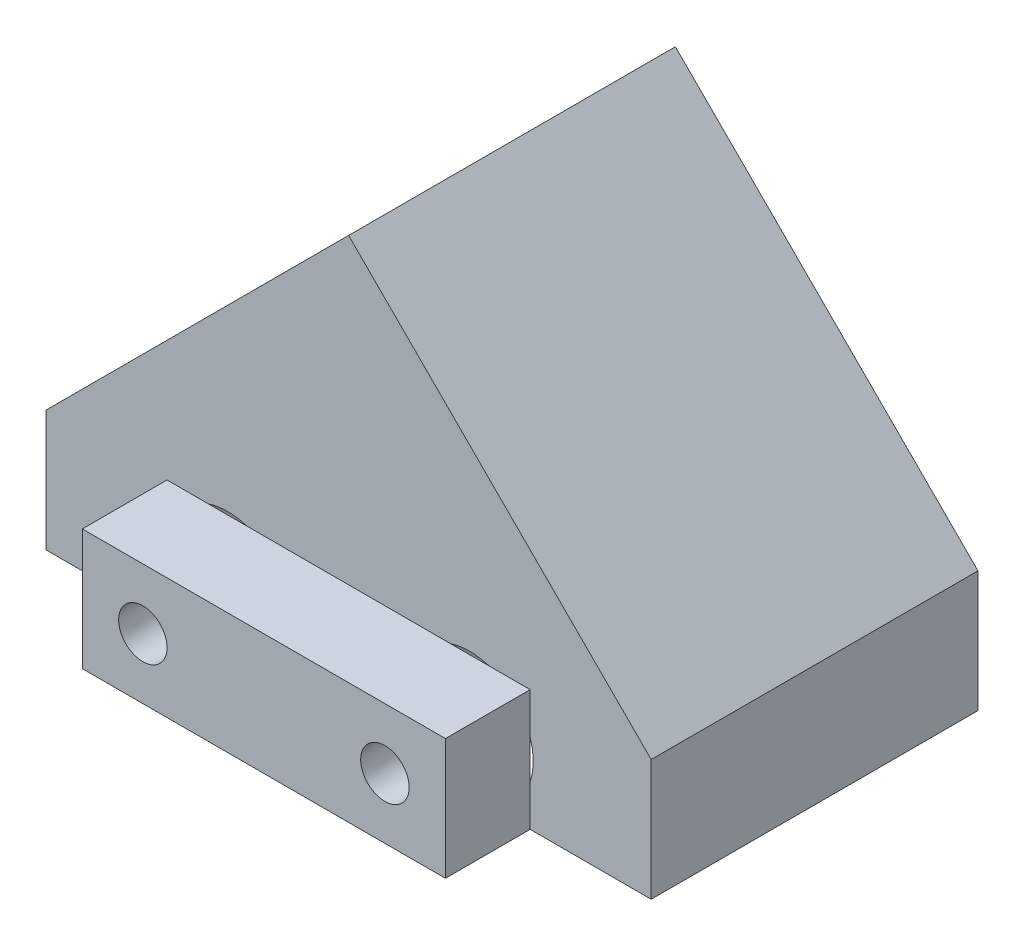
ISO-10303-21;
HEADER;
FILE_DESCRIPTION(('STEP AP214'),'2;1');
FILE_NAME('part.step','',(''),(''),'','','');
FILE_SCHEMA(('AUTOMOTIVE_DESIGN { 1 0 10303 214 1 1 1 1 }'));
ENDSEC;
DATA;
#1=APPLICATION_CONTEXT('core data for automotive mechanical design processes');
#2=APPLICATION_PROTOCOL_DEFINITION('international standard','automotive_design',2000,#1);
#3=PRODUCT_CONTEXT('',#1,'mechanical');
#4=PRODUCT('Part','Part','',(#3));
#5=PRODUCT_RELATED_PRODUCT_CATEGORY('part','',(#4));
#6=PRODUCT_DEFINITION_FORMATION('','',#4);
#7=PRODUCT_DEFINITION_CONTEXT('part definition',#1,'design');
#8=PRODUCT_DEFINITION('design','',#6,#7);
#9=PRODUCT_DEFINITION_SHAPE('','',#8);
#10=(LENGTH_UNIT() NAMED_UNIT(*) SI_UNIT(.MILLI.,.METRE.));
#11=(NAMED_UNIT(*) PLANE_ANGLE_UNIT() SI_UNIT($,.RADIAN.));
#12=(NAMED_UNIT(*) SI_UNIT($,.STERADIAN.) SOLID_ANGLE_UNIT());
#13=UNCERTAINTY_MEASURE_WITH_UNIT(LENGTH_MEASURE(1.E-05),#10,'distance_accuracy_value','');
#14=(GEOMETRIC_REPRESENTATION_CONTEXT(3) GLOBAL_UNCERTAINTY_ASSIGNED_CONTEXT((#13)) GLOBAL_UNIT_ASSIGNED_CONTEXT((#10,
#11,#12)) REPRESENTATION_CONTEXT('',''));
#15=CARTESIAN_POINT('',(0.,0.,0.));
#16=DIRECTION('',(0.,0.,1.));
#17=DIRECTION('',(1.,0.,0.));
#18=AXIS2_PLACEMENT_3D('',#15,#16,#17);
#19=CARTESIAN_POINT('',(0.,0.,27.));
#20=DIRECTION('',(1.,0.,0.));
#21=DIRECTION('',(0.,0.,-1.));
#22=AXIS2_PLACEMENT_3D('',#19,#20,#21);
#23=PLANE('',#22);
#24=DIRECTION('',(0.,-1.,0.));
#25=VECTOR('',#24,1.);
#26=CARTESIAN_POINT('',(0.,0.,27.));
#27=LINE('',#26,#25);
#28=CARTESIAN_POINT('',(0.,10.,27.));
#29=VERTEX_POINT('',#28);
#30=CARTESIAN_POINT('',(0.,0.,27.));
#31=VERTEX_POINT('',#30);
#32=EDGE_CURVE('E324',#29,#31,#27,.T.);
#33=ORIENTED_EDGE('',*,*,#32,.F.);
#34=DIRECTION('',(0.,0.,-1.));
#35=VECTOR('',#34,1.);
#36=CARTESIAN_POINT('',(0.,10.,27.));
#37=LINE('',#36,#35);
#38=CARTESIAN_POINT('',(0.,10.,0.));
#39=VERTEX_POINT('',#38);
#40=EDGE_CURVE('E357',#29,#39,#37,.T.);
#41=ORIENTED_EDGE('',*,*,#40,.T.);
#42=DIRECTION('',(0.,-1.,0.));
#43=VECTOR('',#42,1.);
#44=CARTESIAN_POINT('',(0.,0.,0.));
#45=LINE('',#44,#43);
#46=CARTESIAN_POINT('',(0.,0.,0.));
#47=VERTEX_POINT('',#46);
#48=EDGE_CURVE('E328',#39,#47,#45,.T.);
#49=ORIENTED_EDGE('',*,*,#48,.T.);
#50=DIRECTION('',(0.,0.,-1.));
#51=VECTOR('',#50,1.);
#52=CARTESIAN_POINT('',(0.,0.,27.));
#53=LINE('',#52,#51);
#54=EDGE_CURVE('E313',#31,#47,#53,.T.);
#55=ORIENTED_EDGE('',*,*,#54,.F.);
#56=EDGE_LOOP('',(#33,#41,#49,#55));
#57=FACE_BOUND('',#56,.T.);
#58=ADVANCED_FACE('F39',(#57),#23,.F.);
#59=CARTESIAN_POINT('',(0.,0.,27.));
#60=DIRECTION('',(0.,1.,0.));
#61=DIRECTION('',(0.,0.,1.));
#62=AXIS2_PLACEMENT_3D('',#59,#60,#61);
#63=PLANE('',#62);
#64=DIRECTION('',(1.,0.,0.));
#65=VECTOR('',#64,1.);
#66=CARTESIAN_POINT('',(0.,0.,0.));
#67=LINE('',#66,#65);
#68=CARTESIAN_POINT('',(13.3992189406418,0.,0.));
#69=VERTEX_POINT('',#68);
#70=EDGE_CURVE('E311',#47,#69,#67,.T.);
#71=ORIENTED_EDGE('',*,*,#70,.T.);
#72=DIRECTION('',(0.,0.,1.));
#73=VECTOR('',#72,1.);
#74=CARTESIAN_POINT('',(13.3992189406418,0.,-6.00000000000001));
#75=LINE('',#74,#73);
#76=CARTESIAN_POINT('',(13.3992189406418,0.,27.));
#77=VERTEX_POINT('',#76);
#78=EDGE_CURVE('E61',#69,#77,#75,.T.);
#79=ORIENTED_EDGE('',*,*,#78,.T.);
#80=DIRECTION('',(1.,0.,0.));
#81=VECTOR('',#80,1.);
#82=CARTESIAN_POINT('',(0.,0.,27.));
#83=LINE('',#82,#81);
#84=CARTESIAN_POINT('',(16.6007810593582,0.,27.));
#85=VERTEX_POINT('',#84);
#86=EDGE_CURVE('E237',#77,#85,#83,.T.);
#87=ORIENTED_EDGE('',*,*,#86,.T.);
#88=DIRECTION('',(0.,0.,1.));
#89=VECTOR('',#88,1.);
#90=CARTESIAN_POINT('',(16.6007810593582,0.,-6.00000000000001));
#91=LINE('',#90,#89);
#92=CARTESIAN_POINT('',(16.6007810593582,0.,0.));
#93=VERTEX_POINT('',#92);
#94=EDGE_CURVE('E254',#85,#93,#91,.F.);
#95=ORIENTED_EDGE('',*,*,#94,.T.);
#96=CARTESIAN_POINT('',(33.3992189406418,0.,0.));
#97=VERTEX_POINT('',#96);
#98=EDGE_CURVE('E318',#93,#97,#67,.T.);
#99=ORIENTED_EDGE('',*,*,#98,.T.);
#100=DIRECTION('',(0.,0.,1.));
#101=VECTOR('',#100,1.);
#102=CARTESIAN_POINT('',(33.3992189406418,0.,-6.00000000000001));
#103=LINE('',#102,#101);
#104=CARTESIAN_POINT('',(33.3992189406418,0.,27.));
#105=VERTEX_POINT('',#104);
#106=EDGE_CURVE('E54',#97,#105,#103,.T.);
#107=ORIENTED_EDGE('',*,*,#106,.T.);
#108=DIRECTION('',(1.,0.,0.));
#109=VECTOR('',#108,1.);
#110=CARTESIAN_POINT('',(0.,0.,27.));
#111=LINE('',#110,#109);
#112=CARTESIAN_POINT('',(36.6007810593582,0.,27.));
#113=VERTEX_POINT('',#112);
#114=EDGE_CURVE('E248',#105,#113,#111,.T.);
#115=ORIENTED_EDGE('',*,*,#114,.T.);
#116=DIRECTION('',(0.,0.,1.));
#117=VECTOR('',#116,1.);
#118=CARTESIAN_POINT('',(36.6007810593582,0.,-6.00000000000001));
#119=LINE('',#118,#117);
#120=CARTESIAN_POINT('',(36.6007810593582,0.,0.));
#121=VERTEX_POINT('',#120);
#122=EDGE_CURVE('E236',#113,#121,#119,.F.);
#123=ORIENTED_EDGE('',*,*,#122,.T.);
#124=CARTESIAN_POINT('',(50.,0.,0.));
#125=VERTEX_POINT('',#124);
#126=EDGE_CURVE('E320',#121,#125,#67,.T.);
#127=ORIENTED_EDGE('',*,*,#126,.T.);
#128=DIRECTION('',(0.,0.,-1.));
#129=VECTOR('',#128,1.);
#130=CARTESIAN_POINT('',(50.,0.,27.));
#131=LINE('',#130,#129);
#132=CARTESIAN_POINT('',(50.,0.,27.));
#133=VERTEX_POINT('',#132);
#134=EDGE_CURVE('E344',#133,#125,#131,.T.);
#135=ORIENTED_EDGE('',*,*,#134,.F.);
#136=DIRECTION('',(1.,0.,0.));
#137=VECTOR('',#136,1.);
#138=CARTESIAN_POINT('',(0.,0.,27.));
#139=LINE('',#138,#137);
#140=CARTESIAN_POINT('',(40.,0.,27.));
#141=VERTEX_POINT('',#140);
#142=EDGE_CURVE('E347',#141,#133,#139,.T.);
#143=ORIENTED_EDGE('',*,*,#142,.F.);
#144=DIRECTION('',(0.,0.,-1.));
#145=VECTOR('',#144,1.);
#146=CARTESIAN_POINT('',(40.,0.,34.));
#147=LINE('',#146,#145);
#148=CARTESIAN_POINT('',(40.,0.,34.));
#149=VERTEX_POINT('',#148);
#150=EDGE_CURVE('E373',#149,#141,#147,.T.);
#151=ORIENTED_EDGE('',*,*,#150,.F.);
#152=DIRECTION('',(1.,0.,0.));
#153=VECTOR('',#152,1.);
#154=CARTESIAN_POINT('',(10.,0.,34.));
#155=LINE('',#154,#153);
#156=CARTESIAN_POINT('',(10.,0.,34.));
#157=VERTEX_POINT('',#156);
#158=EDGE_CURVE('E199',#157,#149,#155,.T.);
#159=ORIENTED_EDGE('',*,*,#158,.F.);
#160=DIRECTION('',(0.,0.,-1.));
#161=VECTOR('',#160,1.);
#162=CARTESIAN_POINT('',(10.,0.,34.));
#163=LINE('',#162,#161);
#164=CARTESIAN_POINT('',(10.,0.,27.));
#165=VERTEX_POINT('',#164);
#166=EDGE_CURVE('E367',#157,#165,#163,.T.);
#167=ORIENTED_EDGE('',*,*,#166,.T.);
#168=EDGE_CURVE('E296',#31,#165,#139,.T.);
#169=ORIENTED_EDGE('',*,*,#168,.F.);
#170=ORIENTED_EDGE('',*,*,#54,.T.);
#171=EDGE_LOOP('',(#71,#79,#87,#95,#99,#107,#115,#123,#127,#135,#143,#151,#159,#167,#169,#170));
#172=FACE_BOUND('',#171,.T.);
#173=ADVANCED_FACE('F306',(#172),#63,.F.);
#174=CARTESIAN_POINT('',(50.,0.,27.));
#175=DIRECTION('',(-1.,0.,0.));
#176=DIRECTION('',(0.,0.,1.));
#177=AXIS2_PLACEMENT_3D('',#174,#175,#176);
#178=PLANE('',#177);
#179=DIRECTION('',(0.,1.,0.));
#180=VECTOR('',#179,1.);
#181=CARTESIAN_POINT('',(50.,0.,0.));
#182=LINE('',#181,#180);
#183=CARTESIAN_POINT('',(50.,10.,0.));
#184=VERTEX_POINT('',#183);
#185=EDGE_CURVE('E317',#125,#184,#182,.T.);
#186=ORIENTED_EDGE('',*,*,#185,.T.);
#187=DIRECTION('',(0.,0.,-1.));
#188=VECTOR('',#187,1.);
#189=CARTESIAN_POINT('',(50.,10.,27.));
#190=LINE('',#189,#188);
#191=CARTESIAN_POINT('',(50.,10.,27.));
#192=VERTEX_POINT('',#191);
#193=EDGE_CURVE('E337',#192,#184,#190,.T.);
#194=ORIENTED_EDGE('',*,*,#193,.F.);
#195=DIRECTION('',(0.,1.,0.));
#196=VECTOR('',#195,1.);
#197=CARTESIAN_POINT('',(50.,0.,27.));
#198=LINE('',#197,#196);
#199=EDGE_CURVE('E340',#133,#192,#198,.T.);
#200=ORIENTED_EDGE('',*,*,#199,.F.);
#201=ORIENTED_EDGE('',*,*,#134,.T.);
#202=EDGE_LOOP('',(#186,#194,#200,#201));
#203=FACE_BOUND('',#202,.T.);
#204=ADVANCED_FACE('F396',(#203),#178,.F.);
#205=CARTESIAN_POINT('',(0.,0.,27.));
#206=DIRECTION('',(0.,0.,-1.));
#207=DIRECTION('',(-1.,0.,0.));
#208=AXIS2_PLACEMENT_3D('',#205,#206,#207);
#209=PLANE('',#208);
#210=DIRECTION('',(-1.,0.,0.));
#211=VECTOR('',#210,1.);
#212=CARTESIAN_POINT('',(10.,10.,27.));
#213=LINE('',#212,#211);
#214=CARTESIAN_POINT('',(13.3992189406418,10.,27.));
#215=VERTEX_POINT('',#214);
#216=CARTESIAN_POINT('',(10.,10.,27.));
#217=VERTEX_POINT('',#216);
#218=EDGE_CURVE('E196',#215,#217,#213,.T.);
#219=ORIENTED_EDGE('',*,*,#218,.F.);
#220=CARTESIAN_POINT('',(15.,5.,27.));
#221=DIRECTION('',(0.,0.,1.));
#222=DIRECTION('',(1.,0.,0.));
#223=AXIS2_PLACEMENT_3D('',#220,#221,#222);
#224=CIRCLE('',#223,5.25);
#225=CARTESIAN_POINT('',(16.6007810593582,10.,27.));
#226=VERTEX_POINT('',#225);
#227=EDGE_CURVE('E274',#226,#215,#224,.T.);
#228=ORIENTED_EDGE('',*,*,#227,.F.);
#229=CARTESIAN_POINT('',(33.3992189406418,10.,27.));
#230=VERTEX_POINT('',#229);
#231=EDGE_CURVE('E171',#230,#226,#213,.T.);
#232=ORIENTED_EDGE('',*,*,#231,.F.);
#233=CARTESIAN_POINT('',(35.,5.,27.));
#234=DIRECTION('',(0.,0.,1.));
#235=DIRECTION('',(1.,0.,0.));
#236=AXIS2_PLACEMENT_3D('',#233,#234,#235);
#237=CIRCLE('',#236,5.25);
#238=CARTESIAN_POINT('',(36.6007810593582,10.,27.));
#239=VERTEX_POINT('',#238);
#240=EDGE_CURVE('E175',#239,#230,#237,.T.);
#241=ORIENTED_EDGE('',*,*,#240,.F.);
#242=CARTESIAN_POINT('',(40.,10.,27.));
#243=VERTEX_POINT('',#242);
#244=EDGE_CURVE('E170',#243,#239,#213,.T.);
#245=ORIENTED_EDGE('',*,*,#244,.F.);
#246=DIRECTION('',(0.,1.,0.));
#247=VECTOR('',#246,1.);
#248=CARTESIAN_POINT('',(40.,0.,27.));
#249=LINE('',#248,#247);
#250=CARTESIAN_POINT('',(40.,6.60078105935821,27.));
#251=VERTEX_POINT('',#250);
#252=EDGE_CURVE('E212',#251,#243,#249,.T.);
#253=ORIENTED_EDGE('',*,*,#252,.F.);
#254=CARTESIAN_POINT('',(40.,3.39921894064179,27.));
#255=VERTEX_POINT('',#254);
#256=EDGE_CURVE('E178',#255,#251,#237,.T.);
#257=ORIENTED_EDGE('',*,*,#256,.F.);
#258=EDGE_CURVE('E205',#141,#255,#249,.T.);
#259=ORIENTED_EDGE('',*,*,#258,.F.);
#260=ORIENTED_EDGE('',*,*,#142,.T.);
#261=ORIENTED_EDGE('',*,*,#199,.T.);
#262=DIRECTION('',(-0.707106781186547,0.707106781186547,0.));
#263=VECTOR('',#262,1.);
#264=CARTESIAN_POINT('',(25.,35.,27.));
#265=LINE('',#264,#263);
#266=CARTESIAN_POINT('',(25.,35.,27.));
#267=VERTEX_POINT('',#266);
#268=EDGE_CURVE('E351',#192,#267,#265,.T.);
#269=ORIENTED_EDGE('',*,*,#268,.T.);
#270=DIRECTION('',(-0.707106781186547,-0.707106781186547,0.));
#271=VECTOR('',#270,1.);
#272=CARTESIAN_POINT('',(25.,35.,27.));
#273=LINE('',#272,#271);
#274=EDGE_CURVE('E363',#267,#29,#273,.T.);
#275=ORIENTED_EDGE('',*,*,#274,.T.);
#276=ORIENTED_EDGE('',*,*,#32,.T.);
#277=ORIENTED_EDGE('',*,*,#168,.T.);
#278=DIRECTION('',(0.,-1.,0.));
#279=VECTOR('',#278,1.);
#280=CARTESIAN_POINT('',(10.,0.,27.));
#281=LINE('',#280,#279);
#282=CARTESIAN_POINT('',(10.,3.39921894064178,27.));
#283=VERTEX_POINT('',#282);
#284=EDGE_CURVE('E222',#283,#165,#281,.T.);
#285=ORIENTED_EDGE('',*,*,#284,.F.);
#286=CARTESIAN_POINT('',(10.,6.60078105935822,27.));
#287=VERTEX_POINT('',#286);
#288=EDGE_CURVE('E282',#287,#283,#224,.T.);
#289=ORIENTED_EDGE('',*,*,#288,.F.);
#290=EDGE_CURVE('E217',#217,#287,#281,.T.);
#291=ORIENTED_EDGE('',*,*,#290,.F.);
#292=EDGE_LOOP('',(#219,#228,#232,#241,#245,#253,#257,#259,#260,#261,#269,#275,#276,#277,#285,
#289,#291));
#293=FACE_BOUND('',#292,.T.);
#294=ADVANCED_FACE('F186',(#293),#209,.F.);
#295=CARTESIAN_POINT('',(0.,0.,0.));
#296=DIRECTION('',(0.,0.,-1.));
#297=DIRECTION('',(-1.,0.,0.));
#298=AXIS2_PLACEMENT_3D('',#295,#296,#297);
#299=PLANE('',#298);
#300=CARTESIAN_POINT('',(15.,5.,0.));
#301=DIRECTION('',(0.,0.,-1.));
#302=DIRECTION('',(-1.,0.,0.));
#303=AXIS2_PLACEMENT_3D('',#300,#301,#302);
#304=CIRCLE('',#303,5.25);
#305=EDGE_CURVE('E11',#69,#93,#304,.T.);
#306=ORIENTED_EDGE('',*,*,#305,.F.);
#307=ORIENTED_EDGE('',*,*,#70,.F.);
#308=ORIENTED_EDGE('',*,*,#48,.F.);
#309=DIRECTION('',(-0.707106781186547,-0.707106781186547,0.));
#310=VECTOR('',#309,1.);
#311=CARTESIAN_POINT('',(25.,35.,0.));
#312=LINE('',#311,#310);
#313=CARTESIAN_POINT('',(25.,35.,0.));
#314=VERTEX_POINT('',#313);
#315=EDGE_CURVE('E364',#314,#39,#312,.T.);
#316=ORIENTED_EDGE('',*,*,#315,.F.);
#317=DIRECTION('',(-0.707106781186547,0.707106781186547,0.));
#318=VECTOR('',#317,1.);
#319=CARTESIAN_POINT('',(25.,35.,0.));
#320=LINE('',#319,#318);
#321=EDGE_CURVE('E353',#184,#314,#320,.T.);
#322=ORIENTED_EDGE('',*,*,#321,.F.);
#323=ORIENTED_EDGE('',*,*,#185,.F.);
#324=ORIENTED_EDGE('',*,*,#126,.F.);
#325=CARTESIAN_POINT('',(35.,5.,0.));
#326=DIRECTION('',(0.,0.,-1.));
#327=DIRECTION('',(-1.,0.,0.));
#328=AXIS2_PLACEMENT_3D('',#325,#326,#327);
#329=CIRCLE('',#328,5.25);
#330=EDGE_CURVE('E47',#97,#121,#329,.T.);
#331=ORIENTED_EDGE('',*,*,#330,.F.);
#332=ORIENTED_EDGE('',*,*,#98,.F.);
#333=EDGE_LOOP('',(#306,#307,#308,#316,#322,#323,#324,#331,#332));
#334=FACE_BOUND('',#333,.T.);
#335=ADVANCED_FACE('F391',(#334),#299,.T.);
#336=CARTESIAN_POINT('',(25.,35.,27.));
#337=DIRECTION('',(-0.707106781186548,-0.707106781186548,0.));
#338=DIRECTION('',(0.707106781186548,-0.707106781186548,0.));
#339=AXIS2_PLACEMENT_3D('',#336,#337,#338);
#340=PLANE('',#339);
#341=ORIENTED_EDGE('',*,*,#321,.T.);
#342=DIRECTION('',(0.,0.,-1.));
#343=VECTOR('',#342,1.);
#344=CARTESIAN_POINT('',(25.,35.,27.));
#345=LINE('',#344,#343);
#346=EDGE_CURVE('E333',#267,#314,#345,.T.);
#347=ORIENTED_EDGE('',*,*,#346,.F.);
#348=ORIENTED_EDGE('',*,*,#268,.F.);
#349=ORIENTED_EDGE('',*,*,#193,.T.);
#350=EDGE_LOOP('',(#341,#347,#348,#349));
#351=FACE_BOUND('',#350,.T.);
#352=ADVANCED_FACE('F400',(#351),#340,.F.);
#353=CARTESIAN_POINT('',(25.,35.,27.));
#354=DIRECTION('',(0.707106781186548,-0.707106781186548,0.));
#355=DIRECTION('',(0.707106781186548,0.707106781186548,0.));
#356=AXIS2_PLACEMENT_3D('',#353,#354,#355);
#357=PLANE('',#356);
#358=ORIENTED_EDGE('',*,*,#315,.T.);
#359=ORIENTED_EDGE('',*,*,#40,.F.);
#360=ORIENTED_EDGE('',*,*,#274,.F.);
#361=ORIENTED_EDGE('',*,*,#346,.T.);
#362=EDGE_LOOP('',(#358,#359,#360,#361));
#363=FACE_BOUND('',#362,.T.);
#364=ADVANCED_FACE('F402',(#363),#357,.F.);
#365=CARTESIAN_POINT('',(0.,0.,34.));
#366=DIRECTION('',(0.,0.,-1.));
#367=DIRECTION('',(-1.,0.,0.));
#368=AXIS2_PLACEMENT_3D('',#365,#366,#367);
#369=PLANE('',#368);
#370=DIRECTION('',(0.,-1.,0.));
#371=VECTOR('',#370,1.);
#372=CARTESIAN_POINT('',(10.,0.,34.));
#373=LINE('',#372,#371);
#374=CARTESIAN_POINT('',(10.,10.,34.));
#375=VERTEX_POINT('',#374);
#376=EDGE_CURVE('E195',#375,#157,#373,.T.);
#377=ORIENTED_EDGE('',*,*,#376,.T.);
#378=ORIENTED_EDGE('',*,*,#158,.T.);
#379=DIRECTION('',(0.,1.,0.));
#380=VECTOR('',#379,1.);
#381=CARTESIAN_POINT('',(40.,0.,34.));
#382=LINE('',#381,#380);
#383=CARTESIAN_POINT('',(40.,10.,34.));
#384=VERTEX_POINT('',#383);
#385=EDGE_CURVE('E227',#149,#384,#382,.T.);
#386=ORIENTED_EDGE('',*,*,#385,.T.);
#387=DIRECTION('',(-1.,0.,0.));
#388=VECTOR('',#387,1.);
#389=CARTESIAN_POINT('',(10.,10.,34.));
#390=LINE('',#389,#388);
#391=EDGE_CURVE('E223',#384,#375,#390,.T.);
#392=ORIENTED_EDGE('',*,*,#391,.T.);
#393=EDGE_LOOP('',(#377,#378,#386,#392));
#394=FACE_BOUND('',#393,.T.);
#395=CARTESIAN_POINT('',(15.,5.,34.));
#396=DIRECTION('',(0.,0.,1.));
#397=DIRECTION('',(1.,0.,0.));
#398=AXIS2_PLACEMENT_3D('',#395,#396,#397);
#399=CIRCLE('',#398,2.);
#400=CARTESIAN_POINT('',(17.,5.,34.));
#401=VERTEX_POINT('',#400);
#402=EDGE_CURVE('E238',#401,#401,#399,.T.);
#403=ORIENTED_EDGE('',*,*,#402,.F.);
#404=EDGE_LOOP('',(#403));
#405=FACE_BOUND('',#404,.T.);
#406=CARTESIAN_POINT('',(35.,5.,34.));
#407=DIRECTION('',(0.,0.,1.));
#408=DIRECTION('',(1.,0.,0.));
#409=AXIS2_PLACEMENT_3D('',#406,#407,#408);
#410=CIRCLE('',#409,2.);
#411=CARTESIAN_POINT('',(37.,5.,34.));
#412=VERTEX_POINT('',#411);
#413=EDGE_CURVE('E242',#412,#412,#410,.T.);
#414=ORIENTED_EDGE('',*,*,#413,.F.);
#415=EDGE_LOOP('',(#414));
#416=FACE_BOUND('',#415,.T.);
#417=ADVANCED_FACE('F404',(#394,#405,#416),#369,.F.);
#418=CARTESIAN_POINT('',(10.,0.,34.));
#419=DIRECTION('',(1.,0.,0.));
#420=DIRECTION('',(0.,0.,-1.));
#421=AXIS2_PLACEMENT_3D('',#418,#419,#420);
#422=PLANE('',#421);
#423=ORIENTED_EDGE('',*,*,#290,.T.);
#424=DIRECTION('',(0.,-1.,0.));
#425=VECTOR('',#424,1.);
#426=CARTESIAN_POINT('',(10.,0.,27.));
#427=LINE('',#426,#425);
#428=EDGE_CURVE('E247',#287,#283,#427,.T.);
#429=ORIENTED_EDGE('',*,*,#428,.T.);
#430=ORIENTED_EDGE('',*,*,#284,.T.);
#431=ORIENTED_EDGE('',*,*,#166,.F.);
#432=ORIENTED_EDGE('',*,*,#376,.F.);
#433=DIRECTION('',(0.,0.,-1.));
#434=VECTOR('',#433,1.);
#435=CARTESIAN_POINT('',(10.,10.,34.));
#436=LINE('',#435,#434);
#437=EDGE_CURVE('E226',#375,#217,#436,.T.);
#438=ORIENTED_EDGE('',*,*,#437,.T.);
#439=EDGE_LOOP('',(#423,#429,#430,#431,#432,#438));
#440=FACE_BOUND('',#439,.T.);
#441=ADVANCED_FACE('F301',(#440),#422,.F.);
#442=CARTESIAN_POINT('',(40.,0.,34.));
#443=DIRECTION('',(-1.,0.,0.));
#444=DIRECTION('',(0.,0.,1.));
#445=AXIS2_PLACEMENT_3D('',#442,#443,#444);
#446=PLANE('',#445);
#447=ORIENTED_EDGE('',*,*,#258,.T.);
#448=DIRECTION('',(0.,1.,0.));
#449=VECTOR('',#448,1.);
#450=CARTESIAN_POINT('',(40.,0.,27.));
#451=LINE('',#450,#449);
#452=EDGE_CURVE('E272',#255,#251,#451,.T.);
#453=ORIENTED_EDGE('',*,*,#452,.T.);
#454=ORIENTED_EDGE('',*,*,#252,.T.);
#455=DIRECTION('',(0.,0.,-1.));
#456=VECTOR('',#455,1.);
#457=CARTESIAN_POINT('',(40.,10.,34.));
#458=LINE('',#457,#456);
#459=EDGE_CURVE('E193',#384,#243,#458,.T.);
#460=ORIENTED_EDGE('',*,*,#459,.F.);
#461=ORIENTED_EDGE('',*,*,#385,.F.);
#462=ORIENTED_EDGE('',*,*,#150,.T.);
#463=EDGE_LOOP('',(#447,#453,#454,#460,#461,#462));
#464=FACE_BOUND('',#463,.T.);
#465=ADVANCED_FACE('F380',(#464),#446,.F.);
#466=CARTESIAN_POINT('',(10.,10.,34.));
#467=DIRECTION('',(0.,-1.,0.));
#468=DIRECTION('',(0.,0.,-1.));
#469=AXIS2_PLACEMENT_3D('',#466,#467,#468);
#470=PLANE('',#469);
#471=ORIENTED_EDGE('',*,*,#244,.T.);
#472=EDGE_CURVE('E159',#239,#230,#213,.T.);
#473=ORIENTED_EDGE('',*,*,#472,.T.);
#474=ORIENTED_EDGE('',*,*,#231,.T.);
#475=EDGE_CURVE('E204',#226,#215,#213,.T.);
#476=ORIENTED_EDGE('',*,*,#475,.T.);
#477=ORIENTED_EDGE('',*,*,#218,.T.);
#478=ORIENTED_EDGE('',*,*,#437,.F.);
#479=ORIENTED_EDGE('',*,*,#391,.F.);
#480=ORIENTED_EDGE('',*,*,#459,.T.);
#481=EDGE_LOOP('',(#471,#473,#474,#476,#477,#478,#479,#480));
#482=FACE_BOUND('',#481,.T.);
#483=ADVANCED_FACE('F190',(#482),#470,.F.);
#484=CARTESIAN_POINT('',(15.,5.,34.));
#485=DIRECTION('',(0.,0.,-1.));
#486=DIRECTION('',(-1.,0.,0.));
#487=AXIS2_PLACEMENT_3D('',#484,#485,#486);
#488=CYLINDRICAL_SURFACE('',#487,2.);
#489=ORIENTED_EDGE('',*,*,#402,.T.);
#490=EDGE_LOOP('',(#489));
#491=FACE_BOUND('',#490,.T.);
#492=CARTESIAN_POINT('',(15.,5.,27.));
#493=DIRECTION('',(0.,0.,1.));
#494=DIRECTION('',(1.,0.,0.));
#495=AXIS2_PLACEMENT_3D('',#492,#493,#494);
#496=CIRCLE('',#495,2.);
#497=CARTESIAN_POINT('',(17.,5.,27.));
#498=VERTEX_POINT('',#497);
#499=EDGE_CURVE('E232',#498,#498,#496,.T.);
#500=ORIENTED_EDGE('',*,*,#499,.F.);
#501=EDGE_LOOP('',(#500));
#502=FACE_BOUND('',#501,.T.);
#503=ADVANCED_FACE('F419',(#491,#502),#488,.F.);
#504=CARTESIAN_POINT('',(35.,5.,34.));
#505=DIRECTION('',(0.,0.,-1.));
#506=DIRECTION('',(-1.,0.,0.));
#507=AXIS2_PLACEMENT_3D('',#504,#505,#506);
#508=CYLINDRICAL_SURFACE('',#507,2.);
#509=ORIENTED_EDGE('',*,*,#413,.T.);
#510=EDGE_LOOP('',(#509));
#511=FACE_BOUND('',#510,.T.);
#512=CARTESIAN_POINT('',(35.,5.,27.));
#513=DIRECTION('',(0.,0.,1.));
#514=DIRECTION('',(1.,0.,0.));
#515=AXIS2_PLACEMENT_3D('',#512,#513,#514);
#516=CIRCLE('',#515,2.);
#517=CARTESIAN_POINT('',(37.,5.,27.));
#518=VERTEX_POINT('',#517);
#519=EDGE_CURVE('E243',#518,#518,#516,.T.);
#520=ORIENTED_EDGE('',*,*,#519,.F.);
#521=EDGE_LOOP('',(#520));
#522=FACE_BOUND('',#521,.T.);
#523=ADVANCED_FACE('F416',(#511,#522),#508,.F.);
#524=CARTESIAN_POINT('',(35.,5.,-6.00000000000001));
#525=DIRECTION('',(0.,0.,1.));
#526=DIRECTION('',(1.,0.,0.));
#527=AXIS2_PLACEMENT_3D('',#524,#525,#526);
#528=CYLINDRICAL_SURFACE('',#527,5.25);
#529=ORIENTED_EDGE('',*,*,#330,.T.);
#530=ORIENTED_EDGE('',*,*,#122,.F.);
#531=EDGE_CURVE('E407',#113,#255,#237,.T.);
#532=ORIENTED_EDGE('',*,*,#531,.T.);
#533=ORIENTED_EDGE('',*,*,#256,.T.);
#534=EDGE_CURVE('E162',#251,#239,#237,.T.);
#535=ORIENTED_EDGE('',*,*,#534,.T.);
#536=ORIENTED_EDGE('',*,*,#240,.T.);
#537=EDGE_CURVE('E164',#230,#105,#237,.T.);
#538=ORIENTED_EDGE('',*,*,#537,.T.);
#539=ORIENTED_EDGE('',*,*,#106,.F.);
#540=EDGE_LOOP('',(#529,#530,#532,#533,#535,#536,#538,#539));
#541=FACE_BOUND('',#540,.T.);
#542=ADVANCED_FACE('F174',(#541),#528,.F.);
#543=CARTESIAN_POINT('',(35.,5.,27.));
#544=DIRECTION('',(0.,0.,1.));
#545=DIRECTION('',(1.,0.,0.));
#546=AXIS2_PLACEMENT_3D('',#543,#544,#545);
#547=PLANE('',#546);
#548=ORIENTED_EDGE('',*,*,#519,.T.);
#549=EDGE_LOOP('',(#548));
#550=FACE_BOUND('',#549,.T.);
#551=ORIENTED_EDGE('',*,*,#537,.F.);
#552=ORIENTED_EDGE('',*,*,#472,.F.);
#553=ORIENTED_EDGE('',*,*,#534,.F.);
#554=ORIENTED_EDGE('',*,*,#452,.F.);
#555=ORIENTED_EDGE('',*,*,#531,.F.);
#556=ORIENTED_EDGE('',*,*,#114,.F.);
#557=EDGE_LOOP('',(#551,#552,#553,#554,#555,#556));
#558=FACE_BOUND('',#557,.T.);
#559=ADVANCED_FACE('F161',(#550,#558),#547,.F.);
#560=CARTESIAN_POINT('',(15.,5.,-6.00000000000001));
#561=DIRECTION('',(0.,0.,1.));
#562=DIRECTION('',(1.,0.,0.));
#563=AXIS2_PLACEMENT_3D('',#560,#561,#562);
#564=CYLINDRICAL_SURFACE('',#563,5.25);
#565=ORIENTED_EDGE('',*,*,#305,.T.);
#566=ORIENTED_EDGE('',*,*,#94,.F.);
#567=EDGE_CURVE('E181',#85,#226,#224,.T.);
#568=ORIENTED_EDGE('',*,*,#567,.T.);
#569=ORIENTED_EDGE('',*,*,#227,.T.);
#570=EDGE_CURVE('E277',#215,#287,#224,.T.);
#571=ORIENTED_EDGE('',*,*,#570,.T.);
#572=ORIENTED_EDGE('',*,*,#288,.T.);
#573=EDGE_CURVE('E284',#283,#77,#224,.T.);
#574=ORIENTED_EDGE('',*,*,#573,.T.);
#575=ORIENTED_EDGE('',*,*,#78,.F.);
#576=EDGE_LOOP('',(#565,#566,#568,#569,#571,#572,#574,#575));
#577=FACE_BOUND('',#576,.T.);
#578=ADVANCED_FACE('F290',(#577),#564,.F.);
#579=CARTESIAN_POINT('',(15.,5.,27.));
#580=DIRECTION('',(0.,0.,1.));
#581=DIRECTION('',(1.,0.,0.));
#582=AXIS2_PLACEMENT_3D('',#579,#580,#581);
#583=PLANE('',#582);
#584=ORIENTED_EDGE('',*,*,#499,.T.);
#585=EDGE_LOOP('',(#584));
#586=FACE_BOUND('',#585,.T.);
#587=ORIENTED_EDGE('',*,*,#573,.F.);
#588=ORIENTED_EDGE('',*,*,#428,.F.);
#589=ORIENTED_EDGE('',*,*,#570,.F.);
#590=ORIENTED_EDGE('',*,*,#475,.F.);
#591=ORIENTED_EDGE('',*,*,#567,.F.);
#592=ORIENTED_EDGE('',*,*,#86,.F.);
#593=EDGE_LOOP('',(#587,#588,#589,#590,#591,#592));
#594=FACE_BOUND('',#593,.T.);
#595=ADVANCED_FACE('F293',(#586,#594),#583,.F.);
#596=CLOSED_SHELL('',(#58,#173,#204,#294,#335,#352,#364,#417,#441,#465,#483,#503,#523,#542,#559,
#578,#595));
#597=MANIFOLD_SOLID_BREP('B2',#596);
#598=ADVANCED_BREP_SHAPE_REPRESENTATION('',(#18,#597),#14);
#599=SHAPE_DEFINITION_REPRESENTATION(#9,#598);
ENDSEC;
END-ISO-10303-21;
